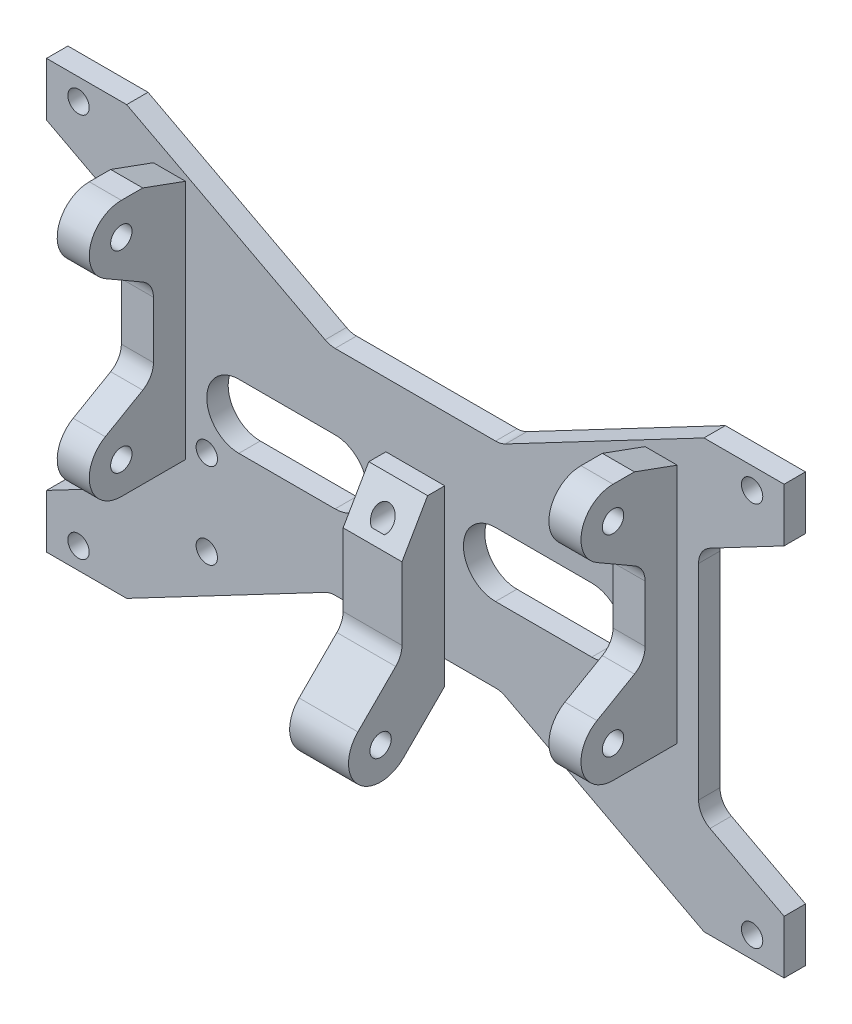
from build123d import *
from OCP.BRepFilletAPI import BRepFilletAPI_MakeChamfer

# Parameters (mm, degrees)
SKETCH2_R           = 3.175
BOSS_EXTRUDE1_DEPTH = 6.35
FILLET1_R           = 6.35
BOSS_EXTRUDE3_START = 77.7748
SKETCH6_R           = 3.175
BOSS_EXTRUDE3_DEPTH = 9.525
BOSS_EXTRUDE4_START = -77.7748
SKETCH7_R           = 3.175
BOSS_EXTRUDE4_DEPTH = 9.525
FILLET4_R           = 6.35
FILLET5_R           = 6.35
SKETCH8_R           = 3.175
BOSS_EXTRUDE5_DEPTH = 8.7376
CHAMFER2_SIZE       = 7.62
CHAMFER2_SIZE2      = 13.198227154
CHAMFER3_SIZE       = 12.7
CHAMFER3_SIZE2      = 4.622421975
CHAMFER4_SIZE       = 12.7
CHAMFER4_SIZE2      = 4.622421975
SKETCH10_R          = 3.175
CUT_EXTRUDE2_DEPTH  = 22.225
SKETCH11_R          = 3.175
CUT_EXTRUDE3_DEPTH  = 17.4752
CHAMFER5_SIZE       = 1.778
CHAMFER5_SIZE2      = 2.95908892
FILLET6_R           = 6.35


with BuildPart() as part:
    # Sketch2 → Boss-Extrude1 (new body)
    with BuildSketch(Plane.XY):
        Polygon((-25.4, -31.75), (25.4, -31.75), (85.725, -63.5), (109.5248, -63.5), (109.5248, -47.625), (84.1248, -34.256578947), (84.1248, 34.256578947), (109.5248, 47.625), (109.5248, 63.5), (85.725, 63.5), (25.4, 31.75), (-25.4, 31.75), (-85.725, 63.5), (-109.5248, 63.5), (-109.5248, 47.625), (-84.1248, 34.256578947), (-84.1248, -34.256578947), (-109.5248, -47.625), (-109.5248, -63.5), (-85.725, -63.5), align=None)
        with Locations((100.0125, 57.15)):
            Circle(SKETCH2_R, mode=Mode.SUBTRACT)
        with Locations((-100.0125, -57.15)):
            Circle(SKETCH2_R, mode=Mode.SUBTRACT)
        with Locations((-100.0125, 57.15)):
            Circle(SKETCH2_R, mode=Mode.SUBTRACT)
        with Locations((100.0125, -57.15)):
            Circle(SKETCH2_R, mode=Mode.SUBTRACT)
        with BuildLine():
            Line((-52.4002, -9.525), (-23.8252, -9.525))
            ThreePointArc((-23.8252, -9.525), (-14.3002, 0), (-23.8252, 9.525))
            Line((-23.8252, 9.525), (-52.4002, 9.525))
            ThreePointArc((-52.4002, 9.525), (-61.9252, 0), (-52.4002, -9.525))
        make_face(mode=Mode.SUBTRACT)
        with BuildLine():
            Line((23.8252, -9.525), (52.4002, -9.525))
            ThreePointArc((52.4002, -9.525), (61.9252, 0), (52.4002, 9.525))
            Line((52.4002, 9.525), (23.8252, 9.525))
            ThreePointArc((23.8252, 9.525), (14.3002, 0), (23.8252, -9.525))
        make_face(mode=Mode.SUBTRACT)
    extrude(amount=BOSS_EXTRUDE1_DEPTH)

    # Fillet1
    fillet1_edges = [part.edges().sort_by_distance(p)[0] for p in [
        (-84.1248, -34.256578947, 3.175),
        (-84.1248, 34.256578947, 3.175),
        (-25.4, 31.75, 3.175),
        (25.4, 31.75, 3.175),
        (84.1248, 34.256578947, 3.175),
        (84.1248, -34.256578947, 3.175),
        (25.4, -31.75, 3.175),
        (-25.4, -31.75, 3.175),
    ]]
    fillet(fillet1_edges, radius=FILLET1_R)


with BuildPart() as body_2:
    # Sketch6 → Boss-Extrude3 (new body)
    with BuildSketch(Plane(origin=(0, 0, 0), x_dir=(0, 0, -1), z_dir=(1, 0, 0)).offset(BOSS_EXTRUDE3_START)):
        with BuildLine():
            Line((-6.35, -19.05), (-6.35, 57.15))
            Line((-6.35, 57.15), (-25.4, 57.15))
            ThreePointArc((-25.4, 57.15), (-34.600443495, 50.090251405), (-30.1625, 39.376108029))
            Line((-30.1625, 39.376108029), (-15.875, 31.127216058))
            Line((-15.875, 31.127216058), (-15.875, 6.972783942))
            Line((-15.875, 6.972783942), (-30.1625, -1.276108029))
            ThreePointArc((-30.1625, -1.276108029), (-34.600443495, -11.990251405), (-25.4, -19.05))
            Line((-25.4, -19.05), (-6.35, -19.05))
        make_face()
        with Locations((-25.4, -9.525)):
            Circle(SKETCH6_R, mode=Mode.SUBTRACT)
        with Locations((-25.4, 47.625)):
            Circle(SKETCH6_R, mode=Mode.SUBTRACT)
    extrude(amount=-BOSS_EXTRUDE3_DEPTH)

    # Fillet5
    fillet5_edges = [body_2.edges().sort_by_distance(p)[0] for p in [
        (73.0123, 6.972783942, 15.875),
        (73.0123, 31.127216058, 15.875),
    ]]
    fillet(fillet5_edges, radius=FILLET5_R)

    # Chamfer4
    chamfer4_edges = [body_2.edges().sort_by_distance(p)[0] for p in [
        (73.0123, 57.15, 6.35),
    ]]
    chamfer4_side = [body_2.faces().sort_by_distance(p)[0] for p in [
        (73.0123, 57.15, 15.875),
    ]]
    chamfer(chamfer4_edges, length=CHAMFER4_SIZE, length2=CHAMFER4_SIZE2, reference=chamfer4_side[0])


with BuildPart() as body_3:
    # Sketch7 → Boss-Extrude4 (new body)
    with BuildSketch(Plane(origin=(0, 0, 0), x_dir=(0, 0, -1), z_dir=(1, 0, 0)).offset(BOSS_EXTRUDE4_START)):
        with BuildLine():
            Line((-6.35, -19.05), (-6.35, 57.15))
            Line((-6.35, 57.15), (-25.4, 57.15))
            ThreePointArc((-25.4, 57.15), (-34.600443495, 50.090251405), (-30.1625, 39.376108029))
            Line((-30.1625, 39.376108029), (-15.875, 31.127216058))
            Line((-15.875, 31.127216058), (-15.875, 6.972783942))
            Line((-15.875, 6.972783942), (-30.1625, -1.276108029))
            ThreePointArc((-30.1625, -1.276108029), (-34.600443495, -11.990251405), (-25.4, -19.05))
            Line((-25.4, -19.05), (-6.35, -19.05))
        make_face()
        with Locations(Location((-25.4, 47.625, 0), (0, 0, 180))):
            Circle(SKETCH7_R, mode=Mode.SUBTRACT)
        with Locations(Location((-25.4, -9.525, 0), (0, 0, 180))):
            Circle(SKETCH7_R, mode=Mode.SUBTRACT)
    extrude(amount=BOSS_EXTRUDE4_DEPTH)

    # Fillet4
    fillet4_edges = [body_3.edges().sort_by_distance(p)[0] for p in [
        (-73.0123, 6.972783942, 15.875),
        (-73.0123, 31.127216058, 15.875),
    ]]
    fillet(fillet4_edges, radius=FILLET4_R)

    # Chamfer3
    chamfer3_edges = [body_3.edges().sort_by_distance(p)[0] for p in [
        (-73.0123, 57.15, 6.35),
    ]]
    chamfer3_side = [body_3.faces().sort_by_distance(p)[0] for p in [
        (-73.0123, 57.15, 15.875),
    ]]
    chamfer(chamfer3_edges, length=CHAMFER3_SIZE, length2=CHAMFER3_SIZE2, reference=chamfer3_side[0])


with BuildPart() as body_4:
    # Sketch8 → Boss-Extrude5 (new, symmetric)
    with BuildSketch(Plane(origin=(0, 0, 0), x_dir=(0, 0, -1), z_dir=(1, 0, 0))):
        with BuildLine():
            Line((-6.35, 12.7), (-19.05, 12.7))
            Line((-19.05, 12.7), (-19.05, -24.629615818))
            Line((-19.05, -24.629615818), (-32.135192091, -37.714807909))
            ThreePointArc((-32.135192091, -37.714807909), (-32.135192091, -51.185192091), (-18.664807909, -51.185192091))
            Line((-18.664807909, -51.185192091), (-6.35, -38.870384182))
            Line((-6.35, -38.870384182), (-6.35, 12.7))
        make_face()
        with Locations((-25.4, -44.45)):
            Circle(SKETCH8_R, mode=Mode.SUBTRACT)
    extrude(amount=BOSS_EXTRUDE5_DEPTH, both=True)

    # Chamfer2
    chamfer2_edges = [body_4.edges().sort_by_distance(p)[0] for p in [
        (0, 12.7, 19.05),
    ]]
    chamfer2_side = [body_4.faces().sort_by_distance(p)[0] for p in [
        (0, 12.7, 12.7),
    ]]
    chamfer(chamfer2_edges, length=CHAMFER2_SIZE, length2=CHAMFER2_SIZE2, reference=chamfer2_side[0])


with BuildPart() as cut_extrude2_tool:
    # Sketch10 → Cut-Extrude2 (new body)
    with BuildSketch(Plane.XY):
        with Locations(Location((-73.025, 38.1, 0), (0, 0, 270))):
            Circle(SKETCH10_R)
        with Locations(Location((-73.025, 0, 0), (0, 0, 270))):
            Circle(SKETCH10_R)
        with Locations(Location((73.025, 38.1, 0), (0, 0, 90))):
            Circle(SKETCH10_R)
        with Locations(Location((73.025, 0, 0), (0, 0, 90))):
            Circle(SKETCH10_R)
        with Locations((-61.9252, -39.5732)):
            Circle(SKETCH10_R)
        with Locations((-61.9252, -14.1732)):
            Circle(SKETCH10_R)
    extrude(amount=CUT_EXTRUDE2_DEPTH)


with BuildPart() as part_1:
    add(part.part)

    # Cut-Extrude2: cut by cut_extrude2_tool
    add(cut_extrude2_tool.part, mode=Mode.SUBTRACT)


with BuildPart() as body_2_1:
    add(body_2.part)

    # Cut-Extrude2: cut by cut_extrude2_tool
    add(cut_extrude2_tool.part, mode=Mode.SUBTRACT)

    # Chamfer5: one chamfer whose edges measure the first distance from different faces: ONE call of the kernel's chamfer builder (chamfer() names one face for all edges)
    chamfer5_edges_1 = [body_2_1.edges().sort_by_distance(p)[0] for p in [
        (73.025, 34.925, 22.225),
    ]]
    chamfer5_side_1 = [body_2_1.faces().sort_by_distance(p)[0] for p in [
        (73.025, 34.925, 14.2875),
    ]]
    chamfer5_edges_2 = [body_2_1.edges().sort_by_distance(p)[0] for p in [
        (73.025, -3.175, 22.225),
    ]]
    chamfer5_side_2 = [body_2_1.faces().sort_by_distance(p)[0] for p in [
        (73.025, -3.175, 14.2875),
    ]]
    chamfer5 = BRepFilletAPI_MakeChamfer(body_2_1.part.solid().wrapped)
    for e in chamfer5_edges_1:
        chamfer5.Add(CHAMFER5_SIZE, CHAMFER5_SIZE2, e.wrapped, chamfer5_side_1[0].wrapped)  # the first distance lies on this face
    for e in chamfer5_edges_2:
        chamfer5.Add(CHAMFER5_SIZE, CHAMFER5_SIZE2, e.wrapped, chamfer5_side_2[0].wrapped)  # the first distance lies on this face
    add(Compound.cast(chamfer5.Shape()), mode=Mode.REPLACE)


with BuildPart() as body_3_1:
    add(body_3.part)

    # Cut-Extrude2: cut by cut_extrude2_tool
    add(cut_extrude2_tool.part, mode=Mode.SUBTRACT)


with BuildPart() as cut_extrude3_tool:
    # Sketch11 → Cut-Extrude3 (new body)
    with BuildSketch(Plane.XY):
        with Locations((0, -22.225)):
            Circle(SKETCH11_R)
        with Locations(Location((0, 4.7752, 0), (0, 0, 233.30470696))):
            Circle(SKETCH11_R)
    extrude(amount=CUT_EXTRUDE3_DEPTH)


with BuildPart() as part_2:
    add(part_1.part)

    # Cut-Extrude3: cut by cut_extrude3_tool
    add(cut_extrude3_tool.part, mode=Mode.SUBTRACT)


with BuildPart() as body_4_1:
    add(body_4.part)

    # Cut-Extrude3: cut by cut_extrude3_tool
    add(cut_extrude3_tool.part, mode=Mode.SUBTRACT)

    # Fillet6
    fillet6_edges = [body_4_1.edges().sort_by_distance(p)[0] for p in [
        (0, -24.629615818, 19.05),
    ]]
    fillet(fillet6_edges, radius=FILLET6_R)


solid = Compound([body_2_1.part, body_3_1.part, part_2.part, body_4_1.part])
